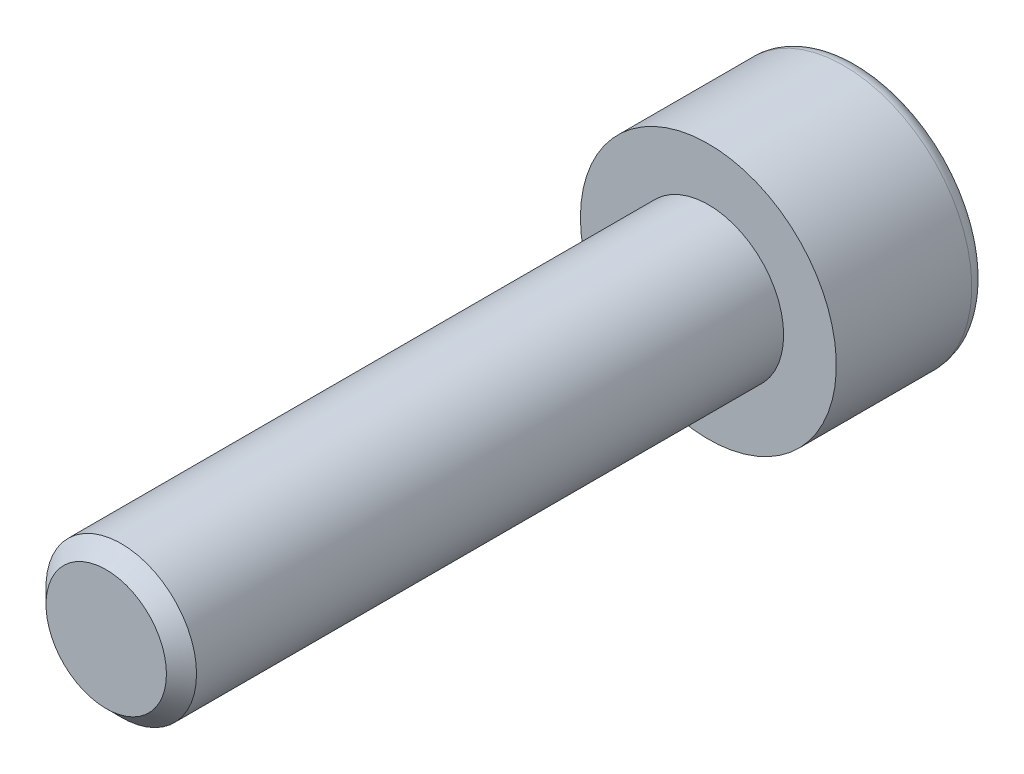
ISO-10303-21;
HEADER;
FILE_DESCRIPTION(('STEP AP214'),'2;1');
FILE_NAME('part.step','',(''),(''),'','','');
FILE_SCHEMA(('AUTOMOTIVE_DESIGN { 1 0 10303 214 1 1 1 1 }'));
ENDSEC;
DATA;
#1=APPLICATION_CONTEXT('core data for automotive mechanical design processes');
#2=APPLICATION_PROTOCOL_DEFINITION('international standard','automotive_design',2000,#1);
#3=PRODUCT_CONTEXT('',#1,'mechanical');
#4=PRODUCT('Part','Part','',(#3));
#5=PRODUCT_RELATED_PRODUCT_CATEGORY('part','',(#4));
#6=PRODUCT_DEFINITION_FORMATION('','',#4);
#7=PRODUCT_DEFINITION_CONTEXT('part definition',#1,'design');
#8=PRODUCT_DEFINITION('design','',#6,#7);
#9=PRODUCT_DEFINITION_SHAPE('','',#8);
#10=(LENGTH_UNIT() NAMED_UNIT(*) SI_UNIT(.MILLI.,.METRE.));
#11=(NAMED_UNIT(*) PLANE_ANGLE_UNIT() SI_UNIT($,.RADIAN.));
#12=(NAMED_UNIT(*) SI_UNIT($,.STERADIAN.) SOLID_ANGLE_UNIT());
#13=UNCERTAINTY_MEASURE_WITH_UNIT(LENGTH_MEASURE(1.E-05),#10,'distance_accuracy_value','');
#14=(GEOMETRIC_REPRESENTATION_CONTEXT(3) GLOBAL_UNCERTAINTY_ASSIGNED_CONTEXT((#13)) GLOBAL_UNIT_ASSIGNED_CONTEXT((#10,
#11,#12)) REPRESENTATION_CONTEXT('',''));
#15=CARTESIAN_POINT('',(0.,0.,0.));
#16=DIRECTION('',(0.,0.,1.));
#17=DIRECTION('',(1.,0.,0.));
#18=AXIS2_PLACEMENT_3D('',#15,#16,#17);
#19=CARTESIAN_POINT('',(0.,0.,-5.));
#20=DIRECTION('',(0.,0.,1.));
#21=DIRECTION('',(1.,0.,0.));
#22=AXIS2_PLACEMENT_3D('',#19,#20,#21);
#23=PLANE('',#22);
#24=CARTESIAN_POINT('',(0.,0.,-5.));
#25=DIRECTION('',(0.,0.,-1.));
#26=DIRECTION('',(-1.,0.,0.));
#27=AXIS2_PLACEMENT_3D('',#24,#25,#26);
#28=CIRCLE('',#27,3.75);
#29=CARTESIAN_POINT('',(-3.75,0.,-5.));
#30=VERTEX_POINT('',#29);
#31=EDGE_CURVE('E141',#30,#30,#28,.T.);
#32=ORIENTED_EDGE('',*,*,#31,.T.);
#33=EDGE_LOOP('',(#32));
#34=FACE_BOUND('',#33,.T.);
#35=DIRECTION('',(-0.86602540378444,0.499999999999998,0.));
#36=VECTOR('',#35,1.);
#37=CARTESIAN_POINT('',(0.,2.30940107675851,-5.));
#38=LINE('',#37,#36);
#39=CARTESIAN_POINT('',(2.,1.15470053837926,-5.));
#40=VERTEX_POINT('',#39);
#41=CARTESIAN_POINT('',(0.,2.30940107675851,-5.));
#42=VERTEX_POINT('',#41);
#43=EDGE_CURVE('E45',#40,#42,#38,.T.);
#44=ORIENTED_EDGE('',*,*,#43,.T.);
#45=DIRECTION('',(-0.866025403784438,-0.500000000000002,0.));
#46=VECTOR('',#45,1.);
#47=CARTESIAN_POINT('',(0.,2.30940107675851,-5.));
#48=LINE('',#47,#46);
#49=CARTESIAN_POINT('',(-2.,1.15470053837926,-5.));
#50=VERTEX_POINT('',#49);
#51=EDGE_CURVE('E85',#42,#50,#48,.T.);
#52=ORIENTED_EDGE('',*,*,#51,.T.);
#53=DIRECTION('',(0.,-1.,0.));
#54=VECTOR('',#53,1.);
#55=CARTESIAN_POINT('',(-2.,-1.15470053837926,-5.));
#56=LINE('',#55,#54);
#57=CARTESIAN_POINT('',(-2.,-1.15470053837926,-5.));
#58=VERTEX_POINT('',#57);
#59=EDGE_CURVE('E93',#50,#58,#56,.T.);
#60=ORIENTED_EDGE('',*,*,#59,.T.);
#61=DIRECTION('',(0.866025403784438,-0.500000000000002,0.));
#62=VECTOR('',#61,1.);
#63=CARTESIAN_POINT('',(0.,-2.30940107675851,-5.));
#64=LINE('',#63,#62);
#65=CARTESIAN_POINT('',(0.,-2.30940107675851,-5.));
#66=VERTEX_POINT('',#65);
#67=EDGE_CURVE('E111',#58,#66,#64,.T.);
#68=ORIENTED_EDGE('',*,*,#67,.T.);
#69=DIRECTION('',(0.86602540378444,0.499999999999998,0.));
#70=VECTOR('',#69,1.);
#71=CARTESIAN_POINT('',(0.,-2.30940107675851,-5.));
#72=LINE('',#71,#70);
#73=CARTESIAN_POINT('',(2.,-1.15470053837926,-5.));
#74=VERTEX_POINT('',#73);
#75=EDGE_CURVE('E114',#66,#74,#72,.T.);
#76=ORIENTED_EDGE('',*,*,#75,.T.);
#77=DIRECTION('',(0.,1.,0.));
#78=VECTOR('',#77,1.);
#79=CARTESIAN_POINT('',(2.,-1.15470053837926,-5.));
#80=LINE('',#79,#78);
#81=EDGE_CURVE('E104',#74,#40,#80,.T.);
#82=ORIENTED_EDGE('',*,*,#81,.T.);
#83=EDGE_LOOP('',(#44,#52,#60,#68,#76,#82));
#84=FACE_BOUND('',#83,.T.);
#85=ADVANCED_FACE('F31',(#34,#84),#23,.F.);
#86=CARTESIAN_POINT('',(0.,0.,-4.5));
#87=DIRECTION('',(0.,0.,-1.));
#88=DIRECTION('',(-1.,0.,0.));
#89=AXIS2_PLACEMENT_3D('',#86,#87,#88);
#90=TOROIDAL_SURFACE('',#89,3.75,0.5);
#91=ORIENTED_EDGE('',*,*,#31,.F.);
#92=EDGE_LOOP('',(#91));
#93=FACE_BOUND('',#92,.T.);
#94=CARTESIAN_POINT('',(0.,0.,-4.5));
#95=DIRECTION('',(0.,0.,-1.));
#96=DIRECTION('',(-1.,0.,0.));
#97=AXIS2_PLACEMENT_3D('',#94,#95,#96);
#98=CIRCLE('',#97,4.25);
#99=CARTESIAN_POINT('',(-4.25,0.,-4.5));
#100=VERTEX_POINT('',#99);
#101=EDGE_CURVE('E138',#100,#100,#98,.T.);
#102=ORIENTED_EDGE('',*,*,#101,.T.);
#103=EDGE_LOOP('',(#102));
#104=FACE_BOUND('',#103,.T.);
#105=ADVANCED_FACE('F160',(#93,#104),#90,.T.);
#106=CARTESIAN_POINT('',(0.,0.,0.));
#107=DIRECTION('',(0.,0.,-1.));
#108=DIRECTION('',(-1.,0.,0.));
#109=AXIS2_PLACEMENT_3D('',#106,#107,#108);
#110=CYLINDRICAL_SURFACE('',#109,4.25);
#111=ORIENTED_EDGE('',*,*,#101,.F.);
#112=EDGE_LOOP('',(#111));
#113=FACE_BOUND('',#112,.T.);
#114=CARTESIAN_POINT('',(0.,0.,0.));
#115=DIRECTION('',(0.,0.,-1.));
#116=DIRECTION('',(-1.,0.,0.));
#117=AXIS2_PLACEMENT_3D('',#114,#115,#116);
#118=CIRCLE('',#117,4.25);
#119=CARTESIAN_POINT('',(-4.25,0.,0.));
#120=VERTEX_POINT('',#119);
#121=EDGE_CURVE('E99',#120,#120,#118,.T.);
#122=ORIENTED_EDGE('',*,*,#121,.T.);
#123=EDGE_LOOP('',(#122));
#124=FACE_BOUND('',#123,.T.);
#125=ADVANCED_FACE('F165',(#113,#124),#110,.T.);
#126=CARTESIAN_POINT('',(0.,0.,0.));
#127=DIRECTION('',(0.,0.,-1.));
#128=DIRECTION('',(-1.,0.,0.));
#129=AXIS2_PLACEMENT_3D('',#126,#127,#128);
#130=PLANE('',#129);
#131=CARTESIAN_POINT('',(0.,0.,0.));
#132=DIRECTION('',(0.,0.,1.));
#133=DIRECTION('',(1.,0.,0.));
#134=AXIS2_PLACEMENT_3D('',#131,#132,#133);
#135=CIRCLE('',#134,2.5);
#136=CARTESIAN_POINT('',(2.5,0.,0.));
#137=VERTEX_POINT('',#136);
#138=EDGE_CURVE('E105',#137,#137,#135,.T.);
#139=ORIENTED_EDGE('',*,*,#138,.F.);
#140=EDGE_LOOP('',(#139));
#141=FACE_BOUND('',#140,.T.);
#142=ORIENTED_EDGE('',*,*,#121,.F.);
#143=EDGE_LOOP('',(#142));
#144=FACE_BOUND('',#143,.T.);
#145=ADVANCED_FACE('F173',(#141,#144),#130,.F.);
#146=CARTESIAN_POINT('',(0.,2.30940107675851,-2.5));
#147=DIRECTION('',(-0.499999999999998,-0.86602540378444,0.));
#148=DIRECTION('',(0.86602540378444,-0.499999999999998,0.));
#149=AXIS2_PLACEMENT_3D('',#146,#147,#148);
#150=PLANE('',#149);
#151=ORIENTED_EDGE('',*,*,#43,.F.);
#152=DIRECTION('',(0.,0.,-1.));
#153=VECTOR('',#152,1.);
#154=CARTESIAN_POINT('',(2.,1.15470053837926,-2.5));
#155=LINE('',#154,#153);
#156=CARTESIAN_POINT('',(2.,1.15470053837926,-2.5));
#157=VERTEX_POINT('',#156);
#158=EDGE_CURVE('E127',#157,#40,#155,.T.);
#159=ORIENTED_EDGE('',*,*,#158,.F.);
#160=DIRECTION('',(-0.86602540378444,0.499999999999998,0.));
#161=VECTOR('',#160,1.);
#162=CARTESIAN_POINT('',(0.,2.30940107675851,-2.5));
#163=LINE('',#162,#161);
#164=CARTESIAN_POINT('',(0.,2.30940107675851,-2.5));
#165=VERTEX_POINT('',#164);
#166=EDGE_CURVE('E98',#157,#165,#163,.T.);
#167=ORIENTED_EDGE('',*,*,#166,.T.);
#168=DIRECTION('',(0.,0.,-1.));
#169=VECTOR('',#168,1.);
#170=CARTESIAN_POINT('',(0.,2.30940107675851,-2.5));
#171=LINE('',#170,#169);
#172=EDGE_CURVE('E87',#165,#42,#171,.T.);
#173=ORIENTED_EDGE('',*,*,#172,.T.);
#174=EDGE_LOOP('',(#151,#159,#167,#173));
#175=FACE_BOUND('',#174,.T.);
#176=ADVANCED_FACE('F96',(#175),#150,.T.);
#177=CARTESIAN_POINT('',(0.,2.30940107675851,-2.5));
#178=DIRECTION('',(0.500000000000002,-0.866025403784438,0.));
#179=DIRECTION('',(0.866025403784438,0.500000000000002,0.));
#180=AXIS2_PLACEMENT_3D('',#177,#178,#179);
#181=PLANE('',#180);
#182=ORIENTED_EDGE('',*,*,#51,.F.);
#183=ORIENTED_EDGE('',*,*,#172,.F.);
#184=DIRECTION('',(-0.866025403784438,-0.500000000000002,0.));
#185=VECTOR('',#184,1.);
#186=CARTESIAN_POINT('',(0.,2.30940107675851,-2.5));
#187=LINE('',#186,#185);
#188=CARTESIAN_POINT('',(-2.,1.15470053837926,-2.5));
#189=VERTEX_POINT('',#188);
#190=EDGE_CURVE('E118',#165,#189,#187,.T.);
#191=ORIENTED_EDGE('',*,*,#190,.T.);
#192=DIRECTION('',(0.,0.,-1.));
#193=VECTOR('',#192,1.);
#194=CARTESIAN_POINT('',(-2.,1.15470053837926,-2.5));
#195=LINE('',#194,#193);
#196=EDGE_CURVE('E89',#189,#50,#195,.T.);
#197=ORIENTED_EDGE('',*,*,#196,.T.);
#198=EDGE_LOOP('',(#182,#183,#191,#197));
#199=FACE_BOUND('',#198,.T.);
#200=ADVANCED_FACE('F86',(#199),#181,.T.);
#201=CARTESIAN_POINT('',(-2.,-1.15470053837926,-2.5));
#202=DIRECTION('',(1.,0.,0.));
#203=DIRECTION('',(0.,0.,-1.));
#204=AXIS2_PLACEMENT_3D('',#201,#202,#203);
#205=PLANE('',#204);
#206=ORIENTED_EDGE('',*,*,#59,.F.);
#207=ORIENTED_EDGE('',*,*,#196,.F.);
#208=DIRECTION('',(0.,-1.,0.));
#209=VECTOR('',#208,1.);
#210=CARTESIAN_POINT('',(-2.,-1.15470053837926,-2.5));
#211=LINE('',#210,#209);
#212=CARTESIAN_POINT('',(-2.,-1.15470053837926,-2.5));
#213=VERTEX_POINT('',#212);
#214=EDGE_CURVE('E120',#189,#213,#211,.T.);
#215=ORIENTED_EDGE('',*,*,#214,.T.);
#216=DIRECTION('',(0.,0.,-1.));
#217=VECTOR('',#216,1.);
#218=CARTESIAN_POINT('',(-2.,-1.15470053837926,-2.5));
#219=LINE('',#218,#217);
#220=EDGE_CURVE('E133',#213,#58,#219,.T.);
#221=ORIENTED_EDGE('',*,*,#220,.T.);
#222=EDGE_LOOP('',(#206,#207,#215,#221));
#223=FACE_BOUND('',#222,.T.);
#224=ADVANCED_FACE('F188',(#223),#205,.T.);
#225=CARTESIAN_POINT('',(0.,-2.30940107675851,-2.5));
#226=DIRECTION('',(0.500000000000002,0.866025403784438,0.));
#227=DIRECTION('',(-0.866025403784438,0.500000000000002,0.));
#228=AXIS2_PLACEMENT_3D('',#225,#226,#227);
#229=PLANE('',#228);
#230=ORIENTED_EDGE('',*,*,#67,.F.);
#231=ORIENTED_EDGE('',*,*,#220,.F.);
#232=DIRECTION('',(0.866025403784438,-0.500000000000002,0.));
#233=VECTOR('',#232,1.);
#234=CARTESIAN_POINT('',(0.,-2.30940107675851,-2.5));
#235=LINE('',#234,#233);
#236=CARTESIAN_POINT('',(0.,-2.30940107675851,-2.5));
#237=VERTEX_POINT('',#236);
#238=EDGE_CURVE('E122',#213,#237,#235,.T.);
#239=ORIENTED_EDGE('',*,*,#238,.T.);
#240=DIRECTION('',(0.,0.,-1.));
#241=VECTOR('',#240,1.);
#242=CARTESIAN_POINT('',(0.,-2.30940107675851,-2.5));
#243=LINE('',#242,#241);
#244=EDGE_CURVE('E131',#237,#66,#243,.T.);
#245=ORIENTED_EDGE('',*,*,#244,.T.);
#246=EDGE_LOOP('',(#230,#231,#239,#245));
#247=FACE_BOUND('',#246,.T.);
#248=ADVANCED_FACE('F191',(#247),#229,.T.);
#249=CARTESIAN_POINT('',(0.,-2.30940107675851,-2.5));
#250=DIRECTION('',(-0.499999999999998,0.86602540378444,0.));
#251=DIRECTION('',(-0.86602540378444,-0.499999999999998,0.));
#252=AXIS2_PLACEMENT_3D('',#249,#250,#251);
#253=PLANE('',#252);
#254=ORIENTED_EDGE('',*,*,#75,.F.);
#255=ORIENTED_EDGE('',*,*,#244,.F.);
#256=DIRECTION('',(0.86602540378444,0.499999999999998,0.));
#257=VECTOR('',#256,1.);
#258=CARTESIAN_POINT('',(0.,-2.30940107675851,-2.5));
#259=LINE('',#258,#257);
#260=CARTESIAN_POINT('',(2.,-1.15470053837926,-2.5));
#261=VERTEX_POINT('',#260);
#262=EDGE_CURVE('E124',#237,#261,#259,.T.);
#263=ORIENTED_EDGE('',*,*,#262,.T.);
#264=DIRECTION('',(0.,0.,-1.));
#265=VECTOR('',#264,1.);
#266=CARTESIAN_POINT('',(2.,-1.15470053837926,-2.5));
#267=LINE('',#266,#265);
#268=EDGE_CURVE('E129',#261,#74,#267,.T.);
#269=ORIENTED_EDGE('',*,*,#268,.T.);
#270=EDGE_LOOP('',(#254,#255,#263,#269));
#271=FACE_BOUND('',#270,.T.);
#272=ADVANCED_FACE('F195',(#271),#253,.T.);
#273=CARTESIAN_POINT('',(2.,-1.15470053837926,-2.5));
#274=DIRECTION('',(-1.,0.,0.));
#275=DIRECTION('',(0.,0.,1.));
#276=AXIS2_PLACEMENT_3D('',#273,#274,#275);
#277=PLANE('',#276);
#278=ORIENTED_EDGE('',*,*,#81,.F.);
#279=ORIENTED_EDGE('',*,*,#268,.F.);
#280=DIRECTION('',(0.,1.,0.));
#281=VECTOR('',#280,1.);
#282=CARTESIAN_POINT('',(2.,-1.15470053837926,-2.5));
#283=LINE('',#282,#281);
#284=EDGE_CURVE('E52',#261,#157,#283,.T.);
#285=ORIENTED_EDGE('',*,*,#284,.T.);
#286=ORIENTED_EDGE('',*,*,#158,.T.);
#287=EDGE_LOOP('',(#278,#279,#285,#286));
#288=FACE_BOUND('',#287,.T.);
#289=ADVANCED_FACE('F199',(#288),#277,.T.);
#290=CARTESIAN_POINT('',(2.,1.15470053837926,-2.5));
#291=DIRECTION('',(0.,0.,1.));
#292=DIRECTION('',(1.,0.,0.));
#293=AXIS2_PLACEMENT_3D('',#290,#291,#292);
#294=PLANE('',#293);
#295=ORIENTED_EDGE('',*,*,#166,.F.);
#296=ORIENTED_EDGE('',*,*,#284,.F.);
#297=ORIENTED_EDGE('',*,*,#262,.F.);
#298=ORIENTED_EDGE('',*,*,#238,.F.);
#299=ORIENTED_EDGE('',*,*,#214,.F.);
#300=ORIENTED_EDGE('',*,*,#190,.F.);
#301=EDGE_LOOP('',(#295,#296,#297,#298,#299,#300));
#302=FACE_BOUND('',#301,.T.);
#303=ADVANCED_FACE('F203',(#302),#294,.F.);
#304=CARTESIAN_POINT('',(0.,0.,20.));
#305=DIRECTION('',(0.,0.,1.));
#306=DIRECTION('',(1.,0.,0.));
#307=AXIS2_PLACEMENT_3D('',#304,#305,#306);
#308=PLANE('',#307);
#309=CARTESIAN_POINT('',(0.,0.,20.));
#310=DIRECTION('',(0.,0.,1.));
#311=DIRECTION('',(1.,0.,0.));
#312=AXIS2_PLACEMENT_3D('',#309,#310,#311);
#313=CIRCLE('',#312,2.);
#314=CARTESIAN_POINT('',(2.,0.,20.));
#315=VERTEX_POINT('',#314);
#316=EDGE_CURVE('E38',#315,#315,#313,.T.);
#317=ORIENTED_EDGE('',*,*,#316,.T.);
#318=EDGE_LOOP('',(#317));
#319=FACE_BOUND('',#318,.T.);
#320=ADVANCED_FACE('F146',(#319),#308,.T.);
#321=CARTESIAN_POINT('',(0.,0.,0.));
#322=DIRECTION('',(0.,0.,1.));
#323=DIRECTION('',(1.,0.,0.));
#324=AXIS2_PLACEMENT_3D('',#321,#322,#323);
#325=CYLINDRICAL_SURFACE('',#324,2.5);
#326=CARTESIAN_POINT('',(0.,0.,19.5));
#327=DIRECTION('',(0.,0.,1.));
#328=DIRECTION('',(1.,0.,0.));
#329=AXIS2_PLACEMENT_3D('',#326,#327,#328);
#330=CIRCLE('',#329,2.5);
#331=CARTESIAN_POINT('',(2.5,0.,19.5));
#332=VERTEX_POINT('',#331);
#333=EDGE_CURVE('E11',#332,#332,#330,.F.);
#334=ORIENTED_EDGE('',*,*,#333,.T.);
#335=EDGE_LOOP('',(#334));
#336=FACE_BOUND('',#335,.T.);
#337=ORIENTED_EDGE('',*,*,#138,.T.);
#338=EDGE_LOOP('',(#337));
#339=FACE_BOUND('',#338,.T.);
#340=ADVANCED_FACE('F150',(#336,#339),#325,.T.);
#341=CARTESIAN_POINT('',(0.,0.,20.));
#342=DIRECTION('',(0.,0.,-1.));
#343=DIRECTION('',(-1.,0.,0.));
#344=AXIS2_PLACEMENT_3D('',#341,#342,#343);
#345=CONICAL_SURFACE('',#344,2.,0.785398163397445);
#346=ORIENTED_EDGE('',*,*,#333,.F.);
#347=EDGE_LOOP('',(#346));
#348=FACE_BOUND('',#347,.T.);
#349=ORIENTED_EDGE('',*,*,#316,.F.);
#350=EDGE_LOOP('',(#349));
#351=FACE_BOUND('',#350,.T.);
#352=ADVANCED_FACE('F148',(#348,#351),#345,.T.);
#353=CLOSED_SHELL('',(#85,#105,#125,#145,#176,#200,#224,#248,#272,#289,#303,#320,#340,#352));
#354=MANIFOLD_SOLID_BREP('B2',#353);
#355=ADVANCED_BREP_SHAPE_REPRESENTATION('',(#18,#354),#14);
#356=SHAPE_DEFINITION_REPRESENTATION(#9,#355);
ENDSEC;
END-ISO-10303-21;
